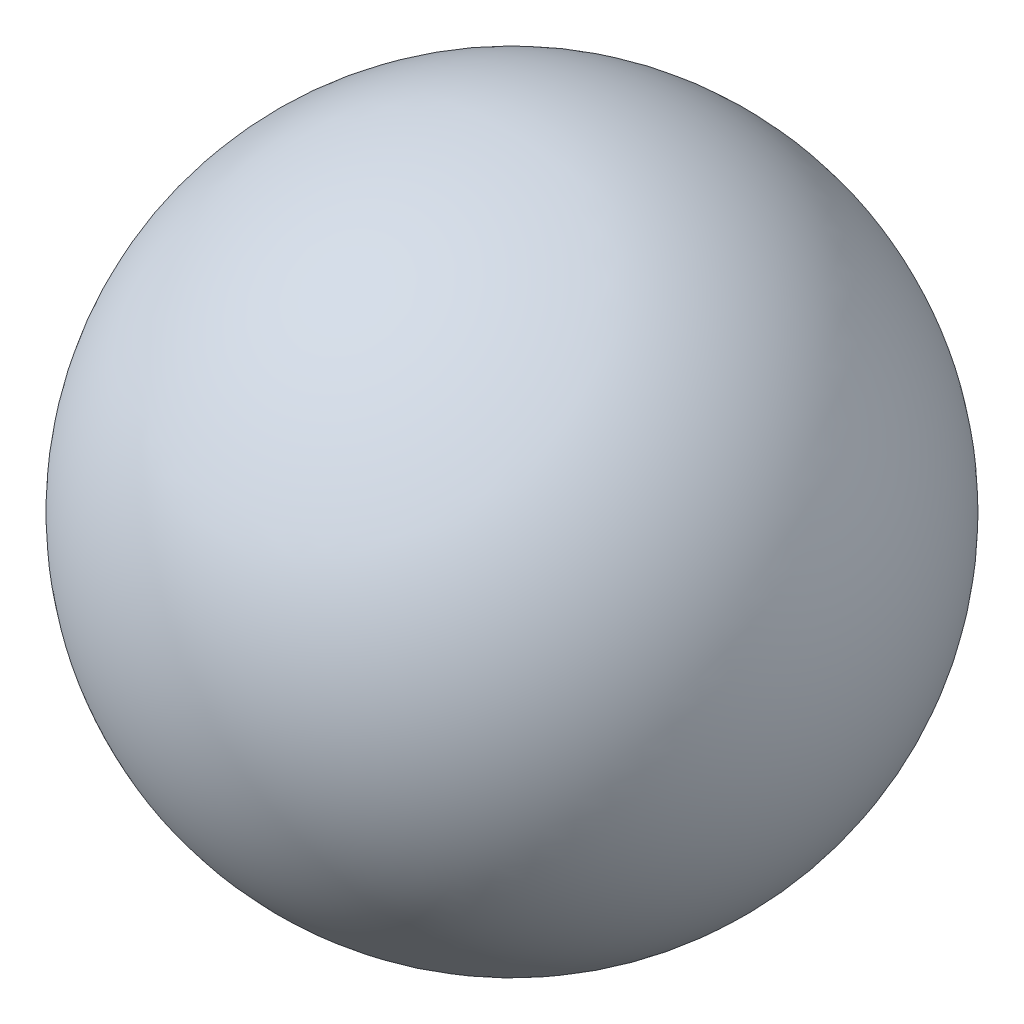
ISO-10303-21;
HEADER;
FILE_DESCRIPTION(('STEP AP214'),'2;1');
FILE_NAME('part.step','',(''),(''),'','','');
FILE_SCHEMA(('AUTOMOTIVE_DESIGN { 1 0 10303 214 1 1 1 1 }'));
ENDSEC;
DATA;
#1=APPLICATION_CONTEXT('core data for automotive mechanical design processes');
#2=APPLICATION_PROTOCOL_DEFINITION('international standard','automotive_design',2000,#1);
#3=PRODUCT_CONTEXT('',#1,'mechanical');
#4=PRODUCT('Part','Part','',(#3));
#5=PRODUCT_RELATED_PRODUCT_CATEGORY('part','',(#4));
#6=PRODUCT_DEFINITION_FORMATION('','',#4);
#7=PRODUCT_DEFINITION_CONTEXT('part definition',#1,'design');
#8=PRODUCT_DEFINITION('design','',#6,#7);
#9=PRODUCT_DEFINITION_SHAPE('','',#8);
#10=(LENGTH_UNIT() NAMED_UNIT(*) SI_UNIT(.MILLI.,.METRE.));
#11=(NAMED_UNIT(*) PLANE_ANGLE_UNIT() SI_UNIT($,.RADIAN.));
#12=(NAMED_UNIT(*) SI_UNIT($,.STERADIAN.) SOLID_ANGLE_UNIT());
#13=UNCERTAINTY_MEASURE_WITH_UNIT(LENGTH_MEASURE(1.E-05),#10,'distance_accuracy_value','');
#14=(GEOMETRIC_REPRESENTATION_CONTEXT(3) GLOBAL_UNCERTAINTY_ASSIGNED_CONTEXT((#13)) GLOBAL_UNIT_ASSIGNED_CONTEXT((#10,
#11,#12)) REPRESENTATION_CONTEXT('',''));
#15=CARTESIAN_POINT('',(0.,0.,0.));
#16=DIRECTION('',(0.,0.,1.));
#17=DIRECTION('',(1.,0.,0.));
#18=AXIS2_PLACEMENT_3D('',#15,#16,#17);
#19=CARTESIAN_POINT('',(0.,0.,21.));
#20=DIRECTION('',(0.,0.,1.));
#21=DIRECTION('',(-1.,0.,0.));
#22=AXIS2_PLACEMENT_3D('',#19,#20,#21);
#23=SPHERICAL_SURFACE('',#22,25.);
#24=CARTESIAN_POINT('',(-2.39744827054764E-07,0.,46.));
#25=VERTEX_POINT('',#24);
#26=VERTEX_LOOP('',#25);
#27=FACE_BOUND('',#26,.T.);
#28=CARTESIAN_POINT('',(0.,0.,0.));
#29=DIRECTION('',(0.,0.,1.));
#30=DIRECTION('',(0.,-1.,0.));
#31=AXIS2_PLACEMENT_3D('',#28,#29,#30);
#32=CIRCLE('',#31,13.5646599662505);
#33=CARTESIAN_POINT('',(0.,-13.5646599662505,0.));
#34=VERTEX_POINT('',#33);
#35=EDGE_CURVE('E30',#34,#34,#32,.T.);
#36=ORIENTED_EDGE('',*,*,#35,.T.);
#37=EDGE_LOOP('',(#36));
#38=FACE_BOUND('',#37,.T.);
#39=ADVANCED_FACE('F14',(#27,#38),#23,.T.);
#40=CARTESIAN_POINT('',(-13.727435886,13.774671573,0.));
#41=DIRECTION('',(0.,0.,1.));
#42=DIRECTION('',(0.,-1.,0.));
#43=AXIS2_PLACEMENT_3D('',#40,#41,#42);
#44=PLANE('',#43);
#45=CARTESIAN_POINT('',(0.,0.,0.));
#46=DIRECTION('',(0.,0.,1.));
#47=DIRECTION('',(0.,-1.,0.));
#48=AXIS2_PLACEMENT_3D('',#45,#46,#47);
#49=CIRCLE('',#48,6.);
#50=CARTESIAN_POINT('',(0.,-6.,0.));
#51=VERTEX_POINT('',#50);
#52=EDGE_CURVE('E21',#51,#51,#49,.T.);
#53=ORIENTED_EDGE('',*,*,#52,.T.);
#54=EDGE_LOOP('',(#53));
#55=FACE_BOUND('',#54,.T.);
#56=ORIENTED_EDGE('',*,*,#35,.F.);
#57=EDGE_LOOP('',(#56));
#58=FACE_BOUND('',#57,.T.);
#59=ADVANCED_FACE('F16',(#55,#58),#44,.F.);
#60=CARTESIAN_POINT('',(0.,0.,0.));
#61=DIRECTION('',(0.,0.,1.));
#62=DIRECTION('',(0.,-1.,0.));
#63=AXIS2_PLACEMENT_3D('',#60,#61,#62);
#64=CYLINDRICAL_SURFACE('',#63,6.);
#65=CARTESIAN_POINT('',(0.,0.,21.));
#66=DIRECTION('',(0.,0.,-1.));
#67=DIRECTION('',(-1.,0.,0.));
#68=AXIS2_PLACEMENT_3D('',#65,#66,#67);
#69=CIRCLE('',#68,6.);
#70=CARTESIAN_POINT('',(-6.,0.,21.));
#71=VERTEX_POINT('',#70);
#72=EDGE_CURVE('E9',#71,#71,#69,.T.);
#73=ORIENTED_EDGE('',*,*,#72,.F.);
#74=EDGE_LOOP('',(#73));
#75=FACE_BOUND('',#74,.T.);
#76=ORIENTED_EDGE('',*,*,#52,.F.);
#77=EDGE_LOOP('',(#76));
#78=FACE_BOUND('',#77,.T.);
#79=ADVANCED_FACE('F37',(#75,#78),#64,.F.);
#80=CARTESIAN_POINT('',(0.,0.,21.));
#81=DIRECTION('',(0.,0.,-1.));
#82=DIRECTION('',(-1.,0.,0.));
#83=AXIS2_PLACEMENT_3D('',#80,#81,#82);
#84=PLANE('',#83);
#85=ORIENTED_EDGE('',*,*,#72,.T.);
#86=EDGE_LOOP('',(#85));
#87=FACE_BOUND('',#86,.T.);
#88=ADVANCED_FACE('F27',(#87),#84,.T.);
#89=CLOSED_SHELL('',(#39,#59,#79,#88));
#90=MANIFOLD_SOLID_BREP('B1',#89);
#91=ADVANCED_BREP_SHAPE_REPRESENTATION('',(#18,#90),#14);
#92=SHAPE_DEFINITION_REPRESENTATION(#9,#91);
ENDSEC;
END-ISO-10303-21;
